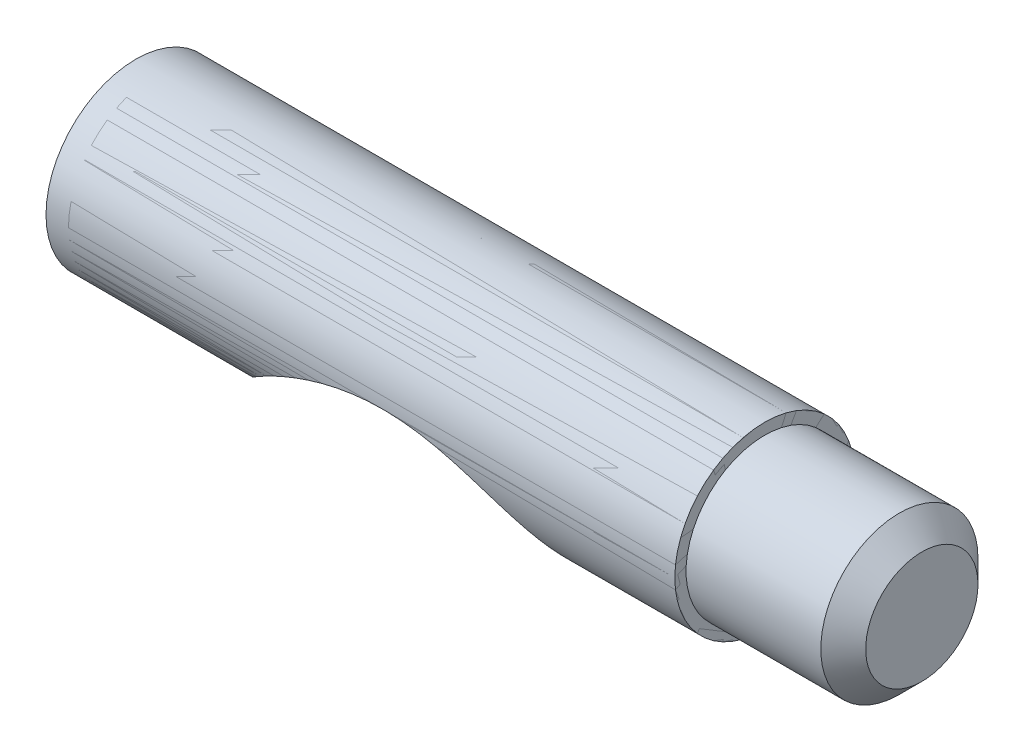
ISO-10303-21;
HEADER;
FILE_DESCRIPTION(('STEP AP214'),'2;1');
FILE_NAME('part.step','',(''),(''),'','','');
FILE_SCHEMA(('AUTOMOTIVE_DESIGN { 1 0 10303 214 1 1 1 1 }'));
ENDSEC;
DATA;
#1=APPLICATION_CONTEXT('core data for automotive mechanical design processes');
#2=APPLICATION_PROTOCOL_DEFINITION('international standard','automotive_design',2000,#1);
#3=PRODUCT_CONTEXT('',#1,'mechanical');
#4=PRODUCT('Part','Part','',(#3));
#5=PRODUCT_RELATED_PRODUCT_CATEGORY('part','',(#4));
#6=PRODUCT_DEFINITION_FORMATION('','',#4);
#7=PRODUCT_DEFINITION_CONTEXT('part definition',#1,'design');
#8=PRODUCT_DEFINITION('design','',#6,#7);
#9=PRODUCT_DEFINITION_SHAPE('','',#8);
#10=(LENGTH_UNIT() NAMED_UNIT(*) SI_UNIT(.MILLI.,.METRE.));
#11=(NAMED_UNIT(*) PLANE_ANGLE_UNIT() SI_UNIT($,.RADIAN.));
#12=(NAMED_UNIT(*) SI_UNIT($,.STERADIAN.) SOLID_ANGLE_UNIT());
#13=UNCERTAINTY_MEASURE_WITH_UNIT(LENGTH_MEASURE(1.E-05),#10,'distance_accuracy_value','');
#14=(GEOMETRIC_REPRESENTATION_CONTEXT(3) GLOBAL_UNCERTAINTY_ASSIGNED_CONTEXT((#13)) GLOBAL_UNIT_ASSIGNED_CONTEXT((#10,
#11,#12)) REPRESENTATION_CONTEXT('',''));
#15=CARTESIAN_POINT('',(0.,0.,0.));
#16=DIRECTION('',(0.,0.,1.));
#17=DIRECTION('',(1.,0.,0.));
#18=AXIS2_PLACEMENT_3D('',#15,#16,#17);
#19=CARTESIAN_POINT('',(1.0218455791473,2.83155948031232,2.40866836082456));
#20=DIRECTION('',(1.,0.,0.));
#21=DIRECTION('',(0.,-1.,0.));
#22=AXIS2_PLACEMENT_3D('',#19,#20,#21);
#23=PLANE('',#22);
#24=CARTESIAN_POINT('',(1.0218455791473,0.,0.));
#25=DIRECTION('',(-1.,0.,0.));
#26=DIRECTION('',(0.,0.,1.));
#27=AXIS2_PLACEMENT_3D('',#24,#25,#26);
#28=CIRCLE('',#27,2.);
#29=CARTESIAN_POINT('',(1.0218455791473,0.,2.));
#30=VERTEX_POINT('',#29);
#31=EDGE_CURVE('P0_E367',#30,#30,#28,.F.);
#32=ORIENTED_EDGE('',*,*,#31,.T.);
#33=EDGE_LOOP('',(#32));
#34=FACE_BOUND('',#33,.T.);
#35=CARTESIAN_POINT('',(1.0218455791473,0.,0.));
#36=DIRECTION('',(1.,0.,0.));
#37=DIRECTION('',(0.,0.,-1.));
#38=AXIS2_PLACEMENT_3D('',#35,#36,#37);
#39=CIRCLE('',#38,1.75);
#40=CARTESIAN_POINT('',(1.0218455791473,0.,-1.75));
#41=VERTEX_POINT('',#40);
#42=EDGE_CURVE('P0_E376',#41,#41,#39,.T.);
#43=ORIENTED_EDGE('',*,*,#42,.F.);
#44=EDGE_LOOP('',(#43));
#45=FACE_BOUND('',#44,.T.);
#46=ADVANCED_FACE('P0_F348',(#34,#45),#23,.T.);
#47=CARTESIAN_POINT('',(-12.978154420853,1.5,-1.5));
#48=DIRECTION('',(-1.,0.,0.));
#49=DIRECTION('',(0.,-1.,0.));
#50=AXIS2_PLACEMENT_3D('',#47,#48,#49);
#51=PLANE('',#50);
#52=CARTESIAN_POINT('',(-12.978154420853,0.,0.));
#53=DIRECTION('',(-1.,0.,0.));
#54=DIRECTION('',(0.,0.,1.));
#55=AXIS2_PLACEMENT_3D('',#52,#53,#54);
#56=CIRCLE('',#55,1.5);
#57=CARTESIAN_POINT('',(-12.978154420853,0.,1.5));
#58=VERTEX_POINT('',#57);
#59=EDGE_CURVE('P0_E358',#58,#58,#56,.T.);
#60=ORIENTED_EDGE('',*,*,#59,.T.);
#61=EDGE_LOOP('',(#60));
#62=FACE_BOUND('',#61,.T.);
#63=ADVANCED_FACE('P0_F385',(#62),#51,.T.);
#64=CARTESIAN_POINT('',(-5.4781544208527,-5.,-2.));
#65=DIRECTION('',(0.,0.,1.));
#66=DIRECTION('',(1.,0.,0.));
#67=AXIS2_PLACEMENT_3D('',#64,#65,#66);
#68=CYLINDRICAL_SURFACE('',#67,5.00000000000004);
#69=CARTESIAN_POINT('',(-9.46526434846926,-1.98288972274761,-0.261052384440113));
#70=CARTESIAN_POINT('',(-9.45658740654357,-1.97142369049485,-0.348145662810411));
#71=CARTESIAN_POINT('',(-9.44353137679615,-1.95424935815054,-0.43404817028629));
#72=CARTESIAN_POINT('',(-9.40835615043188,-1.90898950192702,-0.602961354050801));
#73=CARTESIAN_POINT('',(-9.38605463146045,-1.88068510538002,-0.685875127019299));
#74=CARTESIAN_POINT('',(-9.33167847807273,-1.81373842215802,-0.847501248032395));
#75=CARTESIAN_POINT('',(-9.2993035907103,-1.77478374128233,-0.925982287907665));
#76=CARTESIAN_POINT('',(-9.2237227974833,-1.68726614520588,-1.07757151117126));
#77=CARTESIAN_POINT('',(-9.18007149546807,-1.63833171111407,-1.15024081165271));
#78=CARTESIAN_POINT('',(-9.08045380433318,-1.53170183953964,-1.28920975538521));
#79=CARTESIAN_POINT('',(-9.02386826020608,-1.47364257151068,-1.35478091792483));
#80=CARTESIAN_POINT('',(-8.89628814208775,-1.34966744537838,-1.47876362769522));
#81=CARTESIAN_POINT('',(-8.82447240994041,-1.28350555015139,-1.53607255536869));
#82=CARTESIAN_POINT('',(-8.66334360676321,-1.14420677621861,-1.64296833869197));
#83=CARTESIAN_POINT('',(-8.57297295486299,-1.07111194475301,-1.69098905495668));
#84=CARTESIAN_POINT('',(-8.36966578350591,-0.918635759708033,-1.77903248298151));
#85=CARTESIAN_POINT('',(-8.25535430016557,-0.839867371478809,-1.81690398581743));
#86=CARTESIAN_POINT('',(-8.06569598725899,-0.720781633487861,-1.8662244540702));
#87=CARTESIAN_POINT('',(-7.99313447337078,-0.677724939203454,-1.8821769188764));
#88=CARTESIAN_POINT('',(-7.84531325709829,-0.595034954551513,-1.90993097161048));
#89=CARTESIAN_POINT('',(-7.77005367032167,-0.555401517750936,-1.92173273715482));
#90=CARTESIAN_POINT('',(-7.6035885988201,-0.473121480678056,-1.94378011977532));
#91=CARTESIAN_POINT('',(-7.51193830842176,-0.431203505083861,-1.95337003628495));
#92=CARTESIAN_POINT('',(-7.30534382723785,-0.344188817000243,-1.97076643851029));
#93=CARTESIAN_POINT('',(-7.18975133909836,-0.300457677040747,-1.97770227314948));
#94=CARTESIAN_POINT('',(-6.95744134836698,-0.222292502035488,-1.98799220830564));
#95=CARTESIAN_POINT('',(-6.84077328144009,-0.187717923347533,-1.9914031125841));
#96=CARTESIAN_POINT('',(-6.60513873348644,-0.127145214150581,-1.99618528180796));
#97=CARTESIAN_POINT('',(-6.48617114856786,-0.101151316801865,-1.99755554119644));
#98=CARTESIAN_POINT('',(-6.21993672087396,-0.0530913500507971,-1.99947288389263));
#99=CARTESIAN_POINT('',(-6.07227274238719,-0.0331922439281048,-1.99976840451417));
#100=CARTESIAN_POINT('',(-5.77578608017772,-0.00664801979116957,-2.00003318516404));
#101=CARTESIAN_POINT('',(-5.62696361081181,-5.05713533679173E-07,-2.00000250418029));
#102=CARTESIAN_POINT('',(-5.35648450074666,4.13484786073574E-07,-1.99999795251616));
#103=CARTESIAN_POINT('',(-5.23482338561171,-0.00444278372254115,-2.0000147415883));
#104=CARTESIAN_POINT('',(-4.99214921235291,-0.0221892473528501,-1.99989659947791));
#105=CARTESIAN_POINT('',(-4.87113615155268,-0.0354924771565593,-1.99976166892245));
#106=CARTESIAN_POINT('',(-4.60350949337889,-0.0748457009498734,-1.99871857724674));
#107=CARTESIAN_POINT('',(-4.45721303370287,-0.103078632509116,-1.99764448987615));
#108=CARTESIAN_POINT('',(-4.16781459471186,-0.172461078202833,-1.99285395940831));
#109=CARTESIAN_POINT('',(-4.02471104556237,-0.213604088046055,-1.9891388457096));
#110=CARTESIAN_POINT('',(-3.78797867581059,-0.293245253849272,-1.97864979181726));
#111=CARTESIAN_POINT('',(-3.69315057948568,-0.328388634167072,-1.97323236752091));
#112=CARTESIAN_POINT('',(-3.48524888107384,-0.412674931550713,-1.95753089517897));
#113=CARTESIAN_POINT('',(-3.37279072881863,-0.463194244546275,-1.94643423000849));
#114=CARTESIAN_POINT('',(-3.10988443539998,-0.593159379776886,-1.91162356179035));
#115=CARTESIAN_POINT('',(-2.96158383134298,-0.676232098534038,-1.88468801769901));
#116=CARTESIAN_POINT('',(-2.70090921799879,-0.839885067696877,-1.81688582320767));
#117=CARTESIAN_POINT('',(-2.58663172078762,-0.918640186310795,-1.77902793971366));
#118=CARTESIAN_POINT('',(-2.38334579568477,-1.07110807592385,-1.69099302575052));
#119=CARTESIAN_POINT('',(-2.29296775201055,-1.14420579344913,-1.64296934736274));
#120=CARTESIAN_POINT('',(-2.13183416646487,-1.2835064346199,-1.53607164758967));
#121=CARTESIAN_POINT('',(-2.06002011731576,-1.34966767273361,-1.47876339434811));
#122=CARTESIAN_POINT('',(-1.93244111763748,-1.47364236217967,-1.35478113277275));
#123=CARTESIAN_POINT('',(-1.87585517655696,-1.53170178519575,-1.28920981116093));
#124=CARTESIAN_POINT('',(-1.77623721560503,-1.63833176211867,-1.15024075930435));
#125=CARTESIAN_POINT('',(-1.73258601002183,-1.68726615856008,-1.07757149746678));
#126=CARTESIAN_POINT('',(-1.65700528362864,-1.77478372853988,-0.925982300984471));
#127=CARTESIAN_POINT('',(-1.62463037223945,-1.81373841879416,-0.847501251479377));
#128=CARTESIAN_POINT('',(-1.57025420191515,-1.88068510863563,-0.685875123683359));
#129=CARTESIAN_POINT('',(-1.54795268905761,-1.90898950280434,-0.602961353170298));
#130=CARTESIAN_POINT('',(-1.51277746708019,-1.95424935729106,-0.434048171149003));
#131=CARTESIAN_POINT('',(-1.49972143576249,-1.97142369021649,-0.34814566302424));
#132=CARTESIAN_POINT('',(-1.48245265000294,-1.99424330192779,-0.174813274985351));
#133=CARTESIAN_POINT('',(-1.47815442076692,-2.00000000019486,-0.0874066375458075));
#134=CARTESIAN_POINT('',(-1.47815442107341,-2.00000000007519,0.0874066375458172));
#135=CARTESIAN_POINT('',(-1.48245265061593,-1.99424330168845,0.174813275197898));
#136=CARTESIAN_POINT('',(-1.49972143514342,-1.97142369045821,0.348145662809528));
#137=CARTESIAN_POINT('',(-1.51277746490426,-1.95424935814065,0.434048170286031));
#138=CARTESIAN_POINT('',(-1.54795269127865,-1.90898950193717,0.602961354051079));
#139=CARTESIAN_POINT('',(-1.57025421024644,-1.88068510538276,0.685875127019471));
#140=CARTESIAN_POINT('',(-1.62463036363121,-1.81373842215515,0.847501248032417));
#141=CARTESIAN_POINT('',(-1.65700525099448,-1.77478374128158,0.925982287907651));
#142=CARTESIAN_POINT('',(-1.73258604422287,-1.6872661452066,1.07757151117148));
#143=CARTESIAN_POINT('',(-1.77623734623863,-1.638331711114,1.15024081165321));
#144=CARTESIAN_POINT('',(-1.87585503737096,-1.53170183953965,1.28920975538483));
#145=CARTESIAN_POINT('',(-1.93244058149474,-1.47364257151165,1.35478091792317));
#146=CARTESIAN_POINT('',(-2.06002069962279,-1.34966744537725,1.47876362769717));
#147=CARTESIAN_POINT('',(-2.13183643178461,-1.28350555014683,1.53607255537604));
#148=CARTESIAN_POINT('',(-2.29296523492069,-1.14420677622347,1.642968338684));
#149=CARTESIAN_POINT('',(-2.38333588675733,-1.07111194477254,1.69098905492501));
#150=CARTESIAN_POINT('',(-2.58664305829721,-0.918635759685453,1.77903248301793));
#151=CARTESIAN_POINT('',(-2.70095454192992,-0.839867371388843,1.81690398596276));
#152=CARTESIAN_POINT('',(-2.89061285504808,-0.720781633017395,1.86622445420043));
#153=CARTESIAN_POINT('',(-2.96317436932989,-0.677724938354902,1.88217691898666));
#154=CARTESIAN_POINT('',(-3.11099558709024,-0.595034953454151,1.90993097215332));
#155=CARTESIAN_POINT('',(-3.18625517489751,-0.555401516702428,1.92173273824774));
#156=CARTESIAN_POINT('',(-3.35272023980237,-0.473121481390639,1.94378011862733));
#157=CARTESIAN_POINT('',(-3.44437052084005,-0.431203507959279,1.95337003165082));
#158=CARTESIAN_POINT('',(-3.651014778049,-0.344167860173,1.97077063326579));
#159=CARTESIAN_POINT('',(-3.766658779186,-0.300419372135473,1.97770836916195));
#160=CARTESIAN_POINT('',(-3.99899237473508,-0.222254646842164,1.98799615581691));
#161=CARTESIAN_POINT('',(-4.11563043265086,-0.187691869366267,1.99140542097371));
#162=CARTESIAN_POINT('',(-4.35120362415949,-0.127138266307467,1.99618557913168));
#163=CARTESIAN_POINT('',(-4.47013986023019,-0.101151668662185,1.99755546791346));
#164=CARTESIAN_POINT('',(-4.73634728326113,-0.0530949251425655,1.99947281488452));
#165=CARTESIAN_POINT('',(-4.88401612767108,-0.0331944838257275,1.9997683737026));
#166=CARTESIAN_POINT('',(-5.18051268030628,-0.0066484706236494,2.00003318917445));
#167=CARTESIAN_POINT('',(-5.32934017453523,-5.06770461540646E-07,2.00000250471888));
#168=CARTESIAN_POINT('',(-5.59982442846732,4.14335382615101E-07,1.99999795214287));
#169=CARTESIAN_POINT('',(-5.72148566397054,-0.00444279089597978,2.00001474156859));
#170=CARTESIAN_POINT('',(-5.96416007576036,-0.0221892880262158,1.99989659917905));
#171=CARTESIAN_POINT('',(-6.0851732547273,-0.0354925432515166,1.9997616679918));
#172=CARTESIAN_POINT('',(-6.35280113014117,-0.0748459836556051,1.99871856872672));
#173=CARTESIAN_POINT('',(-6.49909867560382,-0.103079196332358,1.99764446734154));
#174=CARTESIAN_POINT('',(-6.78849923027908,-0.172462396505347,1.99285385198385));
#175=CARTESIAN_POINT('',(-6.93160380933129,-0.213605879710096,1.98913866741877));
#176=CARTESIAN_POINT('',(-7.16833477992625,-0.29324696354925,1.97864952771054));
#177=CARTESIAN_POINT('',(-7.26316053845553,-0.328389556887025,1.97323219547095));
#178=CARTESIAN_POINT('',(-7.47105995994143,-0.412674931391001,1.95753089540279));
#179=CARTESIAN_POINT('',(-7.58351811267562,-0.463194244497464,1.94643423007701));
#180=CARTESIAN_POINT('',(-7.84642440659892,-0.593159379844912,1.91162356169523));
#181=CARTESIAN_POINT('',(-7.99472501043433,-0.676232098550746,1.88468801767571));
#182=CARTESIAN_POINT('',(-8.25539962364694,-0.83988506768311,1.816885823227));
#183=CARTESIAN_POINT('',(-8.36967712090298,-0.918640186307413,1.77902793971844));
#184=CARTESIAN_POINT('',(-8.57296304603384,-1.07110807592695,1.69099302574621));
#185=CARTESIAN_POINT('',(-8.66334108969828,-1.14420579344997,1.64296934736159));
#186=CARTESIAN_POINT('',(-8.82447467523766,-1.28350643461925,1.53607164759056));
#187=CARTESIAN_POINT('',(-8.89628872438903,-1.34966767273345,1.47876339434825));
#188=CARTESIAN_POINT('',(-9.02386772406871,-1.47364236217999,1.3547811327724));
#189=CARTESIAN_POINT('',(-9.0804536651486,-1.53170178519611,1.28920981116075));
#190=CARTESIAN_POINT('',(-9.18007162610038,-1.63833176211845,1.1502407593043));
#191=CARTESIAN_POINT('',(-9.22372283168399,-1.68726615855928,1.07757149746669));
#192=CARTESIAN_POINT('',(-9.29930355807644,-1.77478372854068,0.925982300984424));
#193=CARTESIAN_POINT('',(-9.33167846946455,-1.81373841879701,0.847501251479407));
#194=CARTESIAN_POINT('',(-9.38605463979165,-1.88068510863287,0.685875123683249));
#195=CARTESIAN_POINT('',(-9.40835615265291,-1.90898950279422,0.602961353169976));
#196=CARTESIAN_POINT('',(-9.44353137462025,-1.954249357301,0.434048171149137));
#197=CARTESIAN_POINT('',(-9.45658740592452,-1.97142369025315,0.348145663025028));
#198=CARTESIAN_POINT('',(-9.47385619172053,-1.99424330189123,0.174813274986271));
#199=CARTESIAN_POINT('',(-9.478154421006,-2.00000000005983,0.087406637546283));
#200=CARTESIAN_POINT('',(-9.47815442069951,-1.99999999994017,-0.0874066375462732));
#201=CARTESIAN_POINT('',(-9.47385619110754,-1.99424330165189,-0.174813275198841));
#202=CARTESIAN_POINT('',(-9.46526434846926,-1.98288972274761,-0.261052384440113));
#203=B_SPLINE_CURVE_WITH_KNOTS('',3,(#69,#70,#71,#72,#73,#74,#75,#76,#77,#78,#79,#80,#81,#82,
#83,#84,#85,#86,#87,#88,#89,#90,#91,#92,#93,#94,#95,#96,#97,#98,#99,#100,#101,#102,#103,#104,
#105,#106,#107,#108,#109,#110,#111,#112,#113,#114,#115,#116,#117,#118,#119,#120,#121,#122,#123,
#124,#125,#126,#127,#128,#129,#130,#131,#132,#133,#134,#135,#136,#137,#138,#139,#140,#141,#142,
#143,#144,#145,#146,#147,#148,#149,#150,#151,#152,#153,#154,#155,#156,#157,#158,#159,#160,#161,
#162,#163,#164,#165,#166,#167,#168,#169,#170,#171,#172,#173,#174,#175,#176,#177,#178,#179,#180,
#181,#182,#183,#184,#185,#186,#187,#188,#189,#190,#191,#192,#193,#194,#195,#196,#197,#198,#199,
#200,#201,#202),.UNSPECIFIED.,.T.,.F.,(4,2,2,2,2,2,2,2,2,2,2,2,2,2,2,2,2,2,2,2,2,2,2,2,2,2,2,2,
2,2,2,2,2,2,2,2,2,2,2,2,2,2,2,2,2,2,2,2,2,2,2,2,2,2,2,2,2,2,2,2,2,2,2,2,2,2,4),(0.,
0.264524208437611,0.534533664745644,0.813519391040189,1.1059000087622,1.41742233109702,
1.75576814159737,2.13171808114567,2.56186918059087,2.81929543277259,3.07671066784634,
3.380159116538,3.75107854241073,4.11592276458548,4.48094670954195,4.9273335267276,
5.37363962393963,5.73855125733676,6.10346138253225,6.54985178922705,6.99601765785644,
7.29963508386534,7.67055930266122,8.18508348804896,8.61523458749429,8.99118452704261,
9.32953033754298,9.64105265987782,9.93343327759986,10.2124190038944,10.4824284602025,
10.7469526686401,11.0088825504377,11.2708124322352,11.5353366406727,11.8053460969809,
12.0843318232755,12.3767124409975,12.6882347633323,13.0265805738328,13.402530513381,
13.8326816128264,14.0901078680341,14.3475231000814,14.6509715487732,15.0220533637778,
15.3868014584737,15.751729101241,16.1981308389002,16.644451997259,17.0093639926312,
17.3742744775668,17.8206682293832,18.2668374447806,18.5704474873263,18.9413717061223,
19.45589589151,19.8860469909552,20.2619969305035,20.6003427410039,20.9118650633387,
21.2042456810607,21.4832314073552,21.7532408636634,22.0177650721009,22.2796949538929,
22.5416248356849),.UNSPECIFIED.);
#204=CARTESIAN_POINT('',(-9.46526434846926,-1.98288972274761,-0.261052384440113));
#205=VERTEX_POINT('',#204);
#206=EDGE_CURVE('P0_E368',#205,#205,#203,.T.);
#207=ORIENTED_EDGE('',*,*,#206,.T.);
#208=EDGE_LOOP('',(#207));
#209=FACE_BOUND('',#208,.T.);
#210=ADVANCED_FACE('P0_F381',(#209),#68,.F.);
#211=CARTESIAN_POINT('',(1.0218455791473,0.,0.));
#212=DIRECTION('',(-1.,0.,0.));
#213=DIRECTION('',(0.,0.,1.));
#214=AXIS2_PLACEMENT_3D('',#211,#212,#213);
#215=CYLINDRICAL_SURFACE('',#214,2.);
#216=CARTESIAN_POINT('',(-12.478154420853,0.,0.));
#217=DIRECTION('',(-1.,0.,0.));
#218=DIRECTION('',(0.,0.,1.));
#219=AXIS2_PLACEMENT_3D('',#216,#217,#218);
#220=CIRCLE('',#219,2.);
#221=CARTESIAN_POINT('',(-12.478154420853,0.,2.));
#222=VERTEX_POINT('',#221);
#223=EDGE_CURVE('P0_E362',#222,#222,#220,.F.);
#224=ORIENTED_EDGE('',*,*,#223,.T.);
#225=EDGE_LOOP('',(#224));
#226=FACE_BOUND('',#225,.T.);
#227=ORIENTED_EDGE('',*,*,#206,.F.);
#228=EDGE_LOOP('',(#227));
#229=FACE_BOUND('',#228,.T.);
#230=ORIENTED_EDGE('',*,*,#31,.F.);
#231=EDGE_LOOP('',(#230));
#232=FACE_BOUND('',#231,.T.);
#233=ADVANCED_FACE('P0_F379',(#226,#229,#232),#215,.T.);
#234=CARTESIAN_POINT('',(4.5218455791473,0.,0.));
#235=DIRECTION('',(-1.,0.,0.));
#236=DIRECTION('',(0.,0.,1.));
#237=AXIS2_PLACEMENT_3D('',#234,#235,#236);
#238=CYLINDRICAL_SURFACE('',#237,1.75);
#239=CARTESIAN_POINT('',(4.0218455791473,0.,0.));
#240=DIRECTION('',(1.,0.,0.));
#241=DIRECTION('',(0.,0.,-1.));
#242=AXIS2_PLACEMENT_3D('',#239,#240,#241);
#243=CIRCLE('',#242,1.75);
#244=CARTESIAN_POINT('',(4.0218455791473,0.,-1.75));
#245=VERTEX_POINT('',#244);
#246=EDGE_CURVE('P0_E10',#245,#245,#243,.F.);
#247=ORIENTED_EDGE('',*,*,#246,.T.);
#248=EDGE_LOOP('',(#247));
#249=FACE_BOUND('',#248,.T.);
#250=ORIENTED_EDGE('',*,*,#42,.T.);
#251=EDGE_LOOP('',(#250));
#252=FACE_BOUND('',#251,.T.);
#253=ADVANCED_FACE('P0_F387',(#249,#252),#238,.T.);
#254=CARTESIAN_POINT('',(4.5218455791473,0.,0.));
#255=DIRECTION('',(1.,0.,0.));
#256=DIRECTION('',(0.,0.,-1.));
#257=AXIS2_PLACEMENT_3D('',#254,#255,#256);
#258=PLANE('',#257);
#259=CARTESIAN_POINT('',(4.5218455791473,0.,0.));
#260=DIRECTION('',(1.,0.,0.));
#261=DIRECTION('',(0.,0.,-1.));
#262=AXIS2_PLACEMENT_3D('',#259,#260,#261);
#263=CIRCLE('',#262,1.25);
#264=CARTESIAN_POINT('',(4.5218455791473,0.,-1.25));
#265=VERTEX_POINT('',#264);
#266=EDGE_CURVE('P0_E354',#265,#265,#263,.T.);
#267=ORIENTED_EDGE('',*,*,#266,.T.);
#268=EDGE_LOOP('',(#267));
#269=FACE_BOUND('',#268,.T.);
#270=ADVANCED_FACE('P0_F390',(#269),#258,.T.);
#271=CARTESIAN_POINT('',(-12.478154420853,0.,0.));
#272=DIRECTION('',(1.,0.,0.));
#273=DIRECTION('',(0.,0.,-1.));
#274=AXIS2_PLACEMENT_3D('',#271,#272,#273);
#275=CONICAL_SURFACE('',#274,2.,0.785398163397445);
#276=ORIENTED_EDGE('',*,*,#59,.F.);
#277=EDGE_LOOP('',(#276));
#278=FACE_BOUND('',#277,.T.);
#279=ORIENTED_EDGE('',*,*,#223,.F.);
#280=EDGE_LOOP('',(#279));
#281=FACE_BOUND('',#280,.T.);
#282=ADVANCED_FACE('P0_F393',(#278,#281),#275,.T.);
#283=CARTESIAN_POINT('',(4.5218455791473,0.,0.));
#284=DIRECTION('',(-1.,0.,0.));
#285=DIRECTION('',(0.,0.,1.));
#286=AXIS2_PLACEMENT_3D('',#283,#284,#285);
#287=CONICAL_SURFACE('',#286,1.25,0.785398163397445);
#288=ORIENTED_EDGE('',*,*,#246,.F.);
#289=EDGE_LOOP('',(#288));
#290=FACE_BOUND('',#289,.T.);
#291=ORIENTED_EDGE('',*,*,#266,.F.);
#292=EDGE_LOOP('',(#291));
#293=FACE_BOUND('',#292,.T.);
#294=ADVANCED_FACE('P0_F396',(#290,#293),#287,.T.);
#295=CLOSED_SHELL('',(#46,#63,#210,#233,#253,#270,#282,#294));
#296=MANIFOLD_SOLID_BREP('P0_B2',#295);
#297=CARTESIAN_POINT('',(-12.978154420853,1.5,-1.5));
#298=DIRECTION('',(-1.,0.,0.));
#299=DIRECTION('',(0.,-1.,0.));
#300=AXIS2_PLACEMENT_3D('',#297,#298,#299);
#301=PLANE('',#300);
#302=CARTESIAN_POINT('',(-12.978154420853,0.,0.));
#303=DIRECTION('',(-1.,0.,0.));
#304=DIRECTION('',(0.,0.,1.));
#305=AXIS2_PLACEMENT_3D('',#302,#303,#304);
#306=CIRCLE('',#305,2.);
#307=CARTESIAN_POINT('',(-12.978154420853,0.,2.));
#308=VERTEX_POINT('',#307);
#309=EDGE_CURVE('P1_E9',#308,#308,#306,.F.);
#310=ORIENTED_EDGE('',*,*,#309,.F.);
#311=EDGE_LOOP('',(#310));
#312=FACE_BOUND('',#311,.T.);
#313=ADVANCED_FACE('P1_F13',(#312),#301,.T.);
#314=CARTESIAN_POINT('',(-5.4781544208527,-5.,-2.));
#315=DIRECTION('',(0.,0.,1.));
#316=DIRECTION('',(1.,0.,0.));
#317=AXIS2_PLACEMENT_3D('',#314,#315,#316);
#318=CYLINDRICAL_SURFACE('',#317,5.00000000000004);
#319=CARTESIAN_POINT('',(-9.46526434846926,-1.98288972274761,-0.261052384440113));
#320=CARTESIAN_POINT('',(-9.45658740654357,-1.97142369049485,-0.348145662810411));
#321=CARTESIAN_POINT('',(-9.44353137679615,-1.95424935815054,-0.43404817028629));
#322=CARTESIAN_POINT('',(-9.40835615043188,-1.90898950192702,-0.602961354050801));
#323=CARTESIAN_POINT('',(-9.38605463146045,-1.88068510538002,-0.685875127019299));
#324=CARTESIAN_POINT('',(-9.33167847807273,-1.81373842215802,-0.847501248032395));
#325=CARTESIAN_POINT('',(-9.2993035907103,-1.77478374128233,-0.925982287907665));
#326=CARTESIAN_POINT('',(-9.2237227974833,-1.68726614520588,-1.07757151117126));
#327=CARTESIAN_POINT('',(-9.18007149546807,-1.63833171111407,-1.15024081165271));
#328=CARTESIAN_POINT('',(-9.08045380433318,-1.53170183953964,-1.28920975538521));
#329=CARTESIAN_POINT('',(-9.02386826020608,-1.47364257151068,-1.35478091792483));
#330=CARTESIAN_POINT('',(-8.89628814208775,-1.34966744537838,-1.47876362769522));
#331=CARTESIAN_POINT('',(-8.82447240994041,-1.28350555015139,-1.53607255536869));
#332=CARTESIAN_POINT('',(-8.66334360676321,-1.14420677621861,-1.64296833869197));
#333=CARTESIAN_POINT('',(-8.57297295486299,-1.07111194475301,-1.69098905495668));
#334=CARTESIAN_POINT('',(-8.36966578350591,-0.918635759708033,-1.77903248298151));
#335=CARTESIAN_POINT('',(-8.25535430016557,-0.839867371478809,-1.81690398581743));
#336=CARTESIAN_POINT('',(-8.06569598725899,-0.720781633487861,-1.8662244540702));
#337=CARTESIAN_POINT('',(-7.99313447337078,-0.677724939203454,-1.8821769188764));
#338=CARTESIAN_POINT('',(-7.84531325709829,-0.595034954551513,-1.90993097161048));
#339=CARTESIAN_POINT('',(-7.77005367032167,-0.555401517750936,-1.92173273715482));
#340=CARTESIAN_POINT('',(-7.6035885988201,-0.473121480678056,-1.94378011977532));
#341=CARTESIAN_POINT('',(-7.51193830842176,-0.431203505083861,-1.95337003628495));
#342=CARTESIAN_POINT('',(-7.30534382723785,-0.344188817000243,-1.97076643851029));
#343=CARTESIAN_POINT('',(-7.18975133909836,-0.300457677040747,-1.97770227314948));
#344=CARTESIAN_POINT('',(-6.95744134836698,-0.222292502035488,-1.98799220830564));
#345=CARTESIAN_POINT('',(-6.84077328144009,-0.187717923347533,-1.9914031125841));
#346=CARTESIAN_POINT('',(-6.60513873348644,-0.127145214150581,-1.99618528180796));
#347=CARTESIAN_POINT('',(-6.48617114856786,-0.101151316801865,-1.99755554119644));
#348=CARTESIAN_POINT('',(-6.21993672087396,-0.0530913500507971,-1.99947288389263));
#349=CARTESIAN_POINT('',(-6.07227274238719,-0.0331922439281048,-1.99976840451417));
#350=CARTESIAN_POINT('',(-5.77578608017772,-0.00664801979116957,-2.00003318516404));
#351=CARTESIAN_POINT('',(-5.62696361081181,-5.05713533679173E-07,-2.00000250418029));
#352=CARTESIAN_POINT('',(-5.35648450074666,4.13484786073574E-07,-1.99999795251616));
#353=CARTESIAN_POINT('',(-5.23482338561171,-0.00444278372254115,-2.0000147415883));
#354=CARTESIAN_POINT('',(-4.99214921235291,-0.0221892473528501,-1.99989659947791));
#355=CARTESIAN_POINT('',(-4.87113615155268,-0.0354924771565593,-1.99976166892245));
#356=CARTESIAN_POINT('',(-4.60350949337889,-0.0748457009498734,-1.99871857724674));
#357=CARTESIAN_POINT('',(-4.45721303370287,-0.103078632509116,-1.99764448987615));
#358=CARTESIAN_POINT('',(-4.16781459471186,-0.172461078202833,-1.99285395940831));
#359=CARTESIAN_POINT('',(-4.02471104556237,-0.213604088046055,-1.9891388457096));
#360=CARTESIAN_POINT('',(-3.78797867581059,-0.293245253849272,-1.97864979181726));
#361=CARTESIAN_POINT('',(-3.69315057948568,-0.328388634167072,-1.97323236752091));
#362=CARTESIAN_POINT('',(-3.48524888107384,-0.412674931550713,-1.95753089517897));
#363=CARTESIAN_POINT('',(-3.37279072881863,-0.463194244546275,-1.94643423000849));
#364=CARTESIAN_POINT('',(-3.10988443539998,-0.593159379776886,-1.91162356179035));
#365=CARTESIAN_POINT('',(-2.96158383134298,-0.676232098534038,-1.88468801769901));
#366=CARTESIAN_POINT('',(-2.70090921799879,-0.839885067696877,-1.81688582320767));
#367=CARTESIAN_POINT('',(-2.58663172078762,-0.918640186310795,-1.77902793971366));
#368=CARTESIAN_POINT('',(-2.38334579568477,-1.07110807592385,-1.69099302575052));
#369=CARTESIAN_POINT('',(-2.29296775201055,-1.14420579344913,-1.64296934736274));
#370=CARTESIAN_POINT('',(-2.13183416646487,-1.2835064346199,-1.53607164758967));
#371=CARTESIAN_POINT('',(-2.06002011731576,-1.34966767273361,-1.47876339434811));
#372=CARTESIAN_POINT('',(-1.93244111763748,-1.47364236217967,-1.35478113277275));
#373=CARTESIAN_POINT('',(-1.87585517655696,-1.53170178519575,-1.28920981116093));
#374=CARTESIAN_POINT('',(-1.77623721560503,-1.63833176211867,-1.15024075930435));
#375=CARTESIAN_POINT('',(-1.73258601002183,-1.68726615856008,-1.07757149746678));
#376=CARTESIAN_POINT('',(-1.65700528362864,-1.77478372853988,-0.925982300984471));
#377=CARTESIAN_POINT('',(-1.62463037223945,-1.81373841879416,-0.847501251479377));
#378=CARTESIAN_POINT('',(-1.57025420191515,-1.88068510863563,-0.685875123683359));
#379=CARTESIAN_POINT('',(-1.54795268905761,-1.90898950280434,-0.602961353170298));
#380=CARTESIAN_POINT('',(-1.51277746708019,-1.95424935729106,-0.434048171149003));
#381=CARTESIAN_POINT('',(-1.49972143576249,-1.97142369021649,-0.34814566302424));
#382=CARTESIAN_POINT('',(-1.48245265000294,-1.99424330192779,-0.174813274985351));
#383=CARTESIAN_POINT('',(-1.47815442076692,-2.00000000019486,-0.0874066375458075));
#384=CARTESIAN_POINT('',(-1.47815442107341,-2.00000000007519,0.0874066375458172));
#385=CARTESIAN_POINT('',(-1.48245265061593,-1.99424330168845,0.174813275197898));
#386=CARTESIAN_POINT('',(-1.49972143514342,-1.97142369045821,0.348145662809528));
#387=CARTESIAN_POINT('',(-1.51277746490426,-1.95424935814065,0.434048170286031));
#388=CARTESIAN_POINT('',(-1.54795269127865,-1.90898950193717,0.602961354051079));
#389=CARTESIAN_POINT('',(-1.57025421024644,-1.88068510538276,0.685875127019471));
#390=CARTESIAN_POINT('',(-1.62463036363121,-1.81373842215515,0.847501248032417));
#391=CARTESIAN_POINT('',(-1.65700525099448,-1.77478374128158,0.925982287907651));
#392=CARTESIAN_POINT('',(-1.73258604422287,-1.6872661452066,1.07757151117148));
#393=CARTESIAN_POINT('',(-1.77623734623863,-1.638331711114,1.15024081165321));
#394=CARTESIAN_POINT('',(-1.87585503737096,-1.53170183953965,1.28920975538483));
#395=CARTESIAN_POINT('',(-1.93244058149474,-1.47364257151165,1.35478091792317));
#396=CARTESIAN_POINT('',(-2.06002069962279,-1.34966744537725,1.47876362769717));
#397=CARTESIAN_POINT('',(-2.13183643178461,-1.28350555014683,1.53607255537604));
#398=CARTESIAN_POINT('',(-2.29296523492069,-1.14420677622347,1.642968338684));
#399=CARTESIAN_POINT('',(-2.38333588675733,-1.07111194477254,1.69098905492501));
#400=CARTESIAN_POINT('',(-2.58664305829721,-0.918635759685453,1.77903248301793));
#401=CARTESIAN_POINT('',(-2.70095454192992,-0.839867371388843,1.81690398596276));
#402=CARTESIAN_POINT('',(-2.89061285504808,-0.720781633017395,1.86622445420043));
#403=CARTESIAN_POINT('',(-2.96317436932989,-0.677724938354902,1.88217691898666));
#404=CARTESIAN_POINT('',(-3.11099558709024,-0.595034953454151,1.90993097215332));
#405=CARTESIAN_POINT('',(-3.18625517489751,-0.555401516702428,1.92173273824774));
#406=CARTESIAN_POINT('',(-3.35272023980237,-0.473121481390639,1.94378011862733));
#407=CARTESIAN_POINT('',(-3.44437052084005,-0.431203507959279,1.95337003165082));
#408=CARTESIAN_POINT('',(-3.651014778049,-0.344167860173,1.97077063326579));
#409=CARTESIAN_POINT('',(-3.766658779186,-0.300419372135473,1.97770836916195));
#410=CARTESIAN_POINT('',(-3.99899237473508,-0.222254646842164,1.98799615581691));
#411=CARTESIAN_POINT('',(-4.11563043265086,-0.187691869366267,1.99140542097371));
#412=CARTESIAN_POINT('',(-4.35120362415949,-0.127138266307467,1.99618557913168));
#413=CARTESIAN_POINT('',(-4.47013986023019,-0.101151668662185,1.99755546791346));
#414=CARTESIAN_POINT('',(-4.73634728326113,-0.0530949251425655,1.99947281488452));
#415=CARTESIAN_POINT('',(-4.88401612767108,-0.0331944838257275,1.9997683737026));
#416=CARTESIAN_POINT('',(-5.18051268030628,-0.0066484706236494,2.00003318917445));
#417=CARTESIAN_POINT('',(-5.32934017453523,-5.06770461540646E-07,2.00000250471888));
#418=CARTESIAN_POINT('',(-5.59982442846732,4.14335382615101E-07,1.99999795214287));
#419=CARTESIAN_POINT('',(-5.72148566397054,-0.00444279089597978,2.00001474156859));
#420=CARTESIAN_POINT('',(-5.96416007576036,-0.0221892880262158,1.99989659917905));
#421=CARTESIAN_POINT('',(-6.0851732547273,-0.0354925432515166,1.9997616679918));
#422=CARTESIAN_POINT('',(-6.35280113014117,-0.0748459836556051,1.99871856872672));
#423=CARTESIAN_POINT('',(-6.49909867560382,-0.103079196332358,1.99764446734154));
#424=CARTESIAN_POINT('',(-6.78849923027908,-0.172462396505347,1.99285385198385));
#425=CARTESIAN_POINT('',(-6.93160380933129,-0.213605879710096,1.98913866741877));
#426=CARTESIAN_POINT('',(-7.16833477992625,-0.29324696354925,1.97864952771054));
#427=CARTESIAN_POINT('',(-7.26316053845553,-0.328389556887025,1.97323219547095));
#428=CARTESIAN_POINT('',(-7.47105995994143,-0.412674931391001,1.95753089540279));
#429=CARTESIAN_POINT('',(-7.58351811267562,-0.463194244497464,1.94643423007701));
#430=CARTESIAN_POINT('',(-7.84642440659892,-0.593159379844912,1.91162356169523));
#431=CARTESIAN_POINT('',(-7.99472501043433,-0.676232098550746,1.88468801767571));
#432=CARTESIAN_POINT('',(-8.25539962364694,-0.83988506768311,1.816885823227));
#433=CARTESIAN_POINT('',(-8.36967712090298,-0.918640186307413,1.77902793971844));
#434=CARTESIAN_POINT('',(-8.57296304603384,-1.07110807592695,1.69099302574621));
#435=CARTESIAN_POINT('',(-8.66334108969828,-1.14420579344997,1.64296934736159));
#436=CARTESIAN_POINT('',(-8.82447467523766,-1.28350643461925,1.53607164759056));
#437=CARTESIAN_POINT('',(-8.89628872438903,-1.34966767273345,1.47876339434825));
#438=CARTESIAN_POINT('',(-9.02386772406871,-1.47364236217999,1.3547811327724));
#439=CARTESIAN_POINT('',(-9.0804536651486,-1.53170178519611,1.28920981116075));
#440=CARTESIAN_POINT('',(-9.18007162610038,-1.63833176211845,1.1502407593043));
#441=CARTESIAN_POINT('',(-9.22372283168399,-1.68726615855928,1.07757149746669));
#442=CARTESIAN_POINT('',(-9.29930355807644,-1.77478372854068,0.925982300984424));
#443=CARTESIAN_POINT('',(-9.33167846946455,-1.81373841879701,0.847501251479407));
#444=CARTESIAN_POINT('',(-9.38605463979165,-1.88068510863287,0.685875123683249));
#445=CARTESIAN_POINT('',(-9.40835615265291,-1.90898950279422,0.602961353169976));
#446=CARTESIAN_POINT('',(-9.44353137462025,-1.954249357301,0.434048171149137));
#447=CARTESIAN_POINT('',(-9.45658740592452,-1.97142369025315,0.348145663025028));
#448=CARTESIAN_POINT('',(-9.47385619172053,-1.99424330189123,0.174813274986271));
#449=CARTESIAN_POINT('',(-9.478154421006,-2.00000000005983,0.087406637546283));
#450=CARTESIAN_POINT('',(-9.47815442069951,-1.99999999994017,-0.0874066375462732));
#451=CARTESIAN_POINT('',(-9.47385619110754,-1.99424330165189,-0.174813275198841));
#452=CARTESIAN_POINT('',(-9.46526434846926,-1.98288972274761,-0.261052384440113));
#453=B_SPLINE_CURVE_WITH_KNOTS('',3,(#319,#320,#321,#322,#323,#324,#325,#326,#327,#328,#329,
#330,#331,#332,#333,#334,#335,#336,#337,#338,#339,#340,#341,#342,#343,#344,#345,#346,#347,#348,
#349,#350,#351,#352,#353,#354,#355,#356,#357,#358,#359,#360,#361,#362,#363,#364,#365,#366,#367,
#368,#369,#370,#371,#372,#373,#374,#375,#376,#377,#378,#379,#380,#381,#382,#383,#384,#385,#386,
#387,#388,#389,#390,#391,#392,#393,#394,#395,#396,#397,#398,#399,#400,#401,#402,#403,#404,#405,
#406,#407,#408,#409,#410,#411,#412,#413,#414,#415,#416,#417,#418,#419,#420,#421,#422,#423,#424,
#425,#426,#427,#428,#429,#430,#431,#432,#433,#434,#435,#436,#437,#438,#439,#440,#441,#442,#443,
#444,#445,#446,#447,#448,#449,#450,#451,#452),.UNSPECIFIED.,.T.,.F.,(4,2,2,2,2,2,2,2,2,2,2,2,2,
2,2,2,2,2,2,2,2,2,2,2,2,2,2,2,2,2,2,2,2,2,2,2,2,2,2,2,2,2,2,2,2,2,2,2,2,2,2,2,2,2,2,2,2,2,2,2,2,
2,2,2,2,2,4),(0.,0.264524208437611,0.534533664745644,0.813519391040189,1.1059000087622,
1.41742233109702,1.75576814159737,2.13171808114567,2.56186918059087,2.81929543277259,
3.07671066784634,3.380159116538,3.75107854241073,4.11592276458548,4.48094670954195,
4.9273335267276,5.37363962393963,5.73855125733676,6.10346138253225,6.54985178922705,
6.99601765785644,7.29963508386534,7.67055930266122,8.18508348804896,8.61523458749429,
8.99118452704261,9.32953033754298,9.64105265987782,9.93343327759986,10.2124190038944,
10.4824284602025,10.7469526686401,11.0088825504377,11.2708124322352,11.5353366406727,
11.8053460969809,12.0843318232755,12.3767124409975,12.6882347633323,13.0265805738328,
13.402530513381,13.8326816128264,14.0901078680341,14.3475231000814,14.6509715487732,
15.0220533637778,15.3868014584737,15.751729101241,16.1981308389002,16.644451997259,
17.0093639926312,17.3742744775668,17.8206682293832,18.2668374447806,18.5704474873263,
18.9413717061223,19.45589589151,19.8860469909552,20.2619969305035,20.6003427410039,
20.9118650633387,21.2042456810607,21.4832314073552,21.7532408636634,22.0177650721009,
22.2796949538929,22.5416248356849),.UNSPECIFIED.);
#454=CARTESIAN_POINT('',(-9.46526434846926,-1.98288972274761,-0.261052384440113));
#455=VERTEX_POINT('',#454);
#456=EDGE_CURVE('P1_E25',#455,#455,#453,.T.);
#457=ORIENTED_EDGE('',*,*,#456,.T.);
#458=EDGE_LOOP('',(#457));
#459=FACE_BOUND('',#458,.T.);
#460=ADVANCED_FACE('P1_F41',(#459),#318,.F.);
#461=CARTESIAN_POINT('',(1.0218455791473,0.,0.));
#462=DIRECTION('',(-1.,0.,0.));
#463=DIRECTION('',(0.,0.,1.));
#464=AXIS2_PLACEMENT_3D('',#461,#462,#463);
#465=CYLINDRICAL_SURFACE('',#464,2.);
#466=ORIENTED_EDGE('',*,*,#456,.F.);
#467=EDGE_LOOP('',(#466));
#468=FACE_BOUND('',#467,.T.);
#469=CARTESIAN_POINT('',(1.0218455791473,0.,0.));
#470=DIRECTION('',(-1.,0.,0.));
#471=DIRECTION('',(0.,0.,1.));
#472=AXIS2_PLACEMENT_3D('',#469,#470,#471);
#473=CIRCLE('',#472,2.);
#474=CARTESIAN_POINT('',(1.0218455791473,0.,2.));
#475=VERTEX_POINT('',#474);
#476=EDGE_CURVE('P1_E20',#475,#475,#473,.F.);
#477=ORIENTED_EDGE('',*,*,#476,.F.);
#478=EDGE_LOOP('',(#477));
#479=FACE_BOUND('',#478,.T.);
#480=ORIENTED_EDGE('',*,*,#309,.T.);
#481=EDGE_LOOP('',(#480));
#482=FACE_BOUND('',#481,.T.);
#483=ADVANCED_FACE('P1_F39',(#468,#479,#482),#465,.T.);
#484=CARTESIAN_POINT('',(1.0218455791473,2.83155948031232,2.40866836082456));
#485=DIRECTION('',(1.,0.,0.));
#486=DIRECTION('',(0.,-1.,0.));
#487=AXIS2_PLACEMENT_3D('',#484,#485,#486);
#488=PLANE('',#487);
#489=ORIENTED_EDGE('',*,*,#476,.T.);
#490=EDGE_LOOP('',(#489));
#491=FACE_BOUND('',#490,.T.);
#492=ADVANCED_FACE('P1_F15',(#491),#488,.T.);
#493=CLOSED_SHELL('',(#313,#460,#483,#492));
#494=MANIFOLD_SOLID_BREP('P1_B1',#493);
#495=ADVANCED_BREP_SHAPE_REPRESENTATION('',(#18,#296,#494),#14);
#496=SHAPE_DEFINITION_REPRESENTATION(#9,#495);
ENDSEC;
END-ISO-10303-21;
